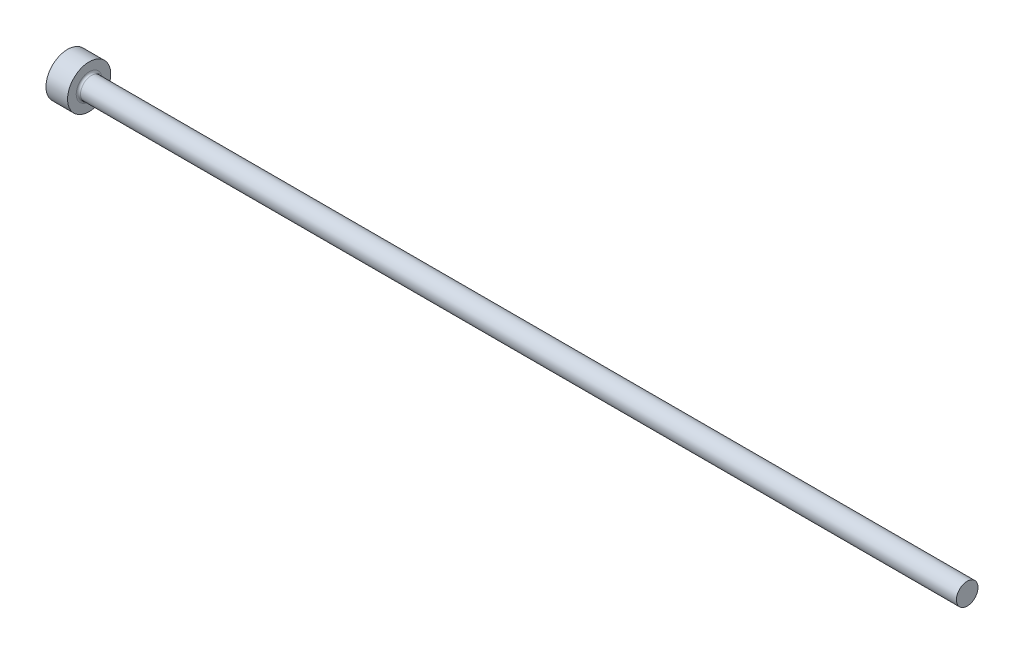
ISO-10303-21;
HEADER;
FILE_DESCRIPTION(('STEP AP214'),'2;1');
FILE_NAME('part.step','',(''),(''),'','','');
FILE_SCHEMA(('AUTOMOTIVE_DESIGN { 1 0 10303 214 1 1 1 1 }'));
ENDSEC;
DATA;
#1=APPLICATION_CONTEXT('core data for automotive mechanical design processes');
#2=APPLICATION_PROTOCOL_DEFINITION('international standard','automotive_design',2000,#1);
#3=PRODUCT_CONTEXT('',#1,'mechanical');
#4=PRODUCT('Part','Part','',(#3));
#5=PRODUCT_RELATED_PRODUCT_CATEGORY('part','',(#4));
#6=PRODUCT_DEFINITION_FORMATION('','',#4);
#7=PRODUCT_DEFINITION_CONTEXT('part definition',#1,'design');
#8=PRODUCT_DEFINITION('design','',#6,#7);
#9=PRODUCT_DEFINITION_SHAPE('','',#8);
#10=(LENGTH_UNIT() NAMED_UNIT(*) SI_UNIT(.MILLI.,.METRE.));
#11=(NAMED_UNIT(*) PLANE_ANGLE_UNIT() SI_UNIT($,.RADIAN.));
#12=(NAMED_UNIT(*) SI_UNIT($,.STERADIAN.) SOLID_ANGLE_UNIT());
#13=UNCERTAINTY_MEASURE_WITH_UNIT(LENGTH_MEASURE(1.E-05),#10,'distance_accuracy_value','');
#14=(GEOMETRIC_REPRESENTATION_CONTEXT(3) GLOBAL_UNCERTAINTY_ASSIGNED_CONTEXT((#13)) GLOBAL_UNIT_ASSIGNED_CONTEXT((#10,
#11,#12)) REPRESENTATION_CONTEXT('',''));
#15=CARTESIAN_POINT('',(0.,0.,0.));
#16=DIRECTION('',(0.,0.,1.));
#17=DIRECTION('',(1.,0.,0.));
#18=AXIS2_PLACEMENT_3D('',#15,#16,#17);
#19=CARTESIAN_POINT('',(0.,0.,0.));
#20=DIRECTION('',(-1.,0.,0.));
#21=DIRECTION('',(0.,-1.,0.));
#22=AXIS2_PLACEMENT_3D('',#19,#20,#21);
#23=PLANE('',#22);
#24=CARTESIAN_POINT('',(0.,0.,0.));
#25=DIRECTION('',(1.,0.,0.));
#26=DIRECTION('',(0.,1.,0.));
#27=AXIS2_PLACEMENT_3D('',#24,#25,#26);
#28=CIRCLE('',#27,3.);
#29=CARTESIAN_POINT('',(0.,3.,0.));
#30=VERTEX_POINT('',#29);
#31=EDGE_CURVE('E25',#30,#30,#28,.T.);
#32=ORIENTED_EDGE('',*,*,#31,.F.);
#33=EDGE_LOOP('',(#32));
#34=FACE_BOUND('',#33,.T.);
#35=ADVANCED_FACE('F14',(#34),#23,.T.);
#36=CARTESIAN_POINT('',(125.,0.,0.));
#37=DIRECTION('',(1.,0.,0.));
#38=DIRECTION('',(0.,1.,0.));
#39=AXIS2_PLACEMENT_3D('',#36,#37,#38);
#40=CYLINDRICAL_SURFACE('',#39,3.);
#41=ORIENTED_EDGE('',*,*,#31,.T.);
#42=EDGE_LOOP('',(#41));
#43=FACE_BOUND('',#42,.T.);
#44=CARTESIAN_POINT('',(3.,0.,0.));
#45=DIRECTION('',(1.,0.,0.));
#46=DIRECTION('',(0.,1.,0.));
#47=AXIS2_PLACEMENT_3D('',#44,#45,#46);
#48=CIRCLE('',#47,3.);
#49=CARTESIAN_POINT('',(3.,3.,0.));
#50=VERTEX_POINT('',#49);
#51=EDGE_CURVE('E29',#50,#50,#48,.T.);
#52=ORIENTED_EDGE('',*,*,#51,.F.);
#53=EDGE_LOOP('',(#52));
#54=FACE_BOUND('',#53,.T.);
#55=ADVANCED_FACE('F51',(#43,#54),#40,.T.);
#56=CARTESIAN_POINT('',(3.,3.,0.));
#57=DIRECTION('',(1.,0.,0.));
#58=DIRECTION('',(0.,1.,0.));
#59=AXIS2_PLACEMENT_3D('',#56,#57,#58);
#60=PLANE('',#59);
#61=CARTESIAN_POINT('',(3.,0.,0.));
#62=DIRECTION('',(1.,0.,0.));
#63=DIRECTION('',(0.,1.,0.));
#64=AXIS2_PLACEMENT_3D('',#61,#62,#63);
#65=CIRCLE('',#64,1.79999999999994);
#66=CARTESIAN_POINT('',(3.,1.79999999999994,0.));
#67=VERTEX_POINT('',#66);
#68=EDGE_CURVE('E9',#67,#67,#65,.F.);
#69=ORIENTED_EDGE('',*,*,#68,.T.);
#70=EDGE_LOOP('',(#69));
#71=FACE_BOUND('',#70,.T.);
#72=ORIENTED_EDGE('',*,*,#51,.T.);
#73=EDGE_LOOP('',(#72));
#74=FACE_BOUND('',#73,.T.);
#75=ADVANCED_FACE('F42',(#71,#74),#60,.T.);
#76=CARTESIAN_POINT('',(125.,0.,0.));
#77=DIRECTION('',(1.,0.,0.));
#78=DIRECTION('',(0.,1.,0.));
#79=AXIS2_PLACEMENT_3D('',#76,#77,#78);
#80=CYLINDRICAL_SURFACE('',#79,1.49999999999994);
#81=CARTESIAN_POINT('',(3.3,0.,0.));
#82=DIRECTION('',(1.,0.,0.));
#83=DIRECTION('',(0.,1.,0.));
#84=AXIS2_PLACEMENT_3D('',#81,#82,#83);
#85=CIRCLE('',#84,1.49999999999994);
#86=CARTESIAN_POINT('',(3.3,1.49999999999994,0.));
#87=VERTEX_POINT('',#86);
#88=EDGE_CURVE('E21',#87,#87,#85,.T.);
#89=ORIENTED_EDGE('',*,*,#88,.T.);
#90=EDGE_LOOP('',(#89));
#91=FACE_BOUND('',#90,.T.);
#92=CARTESIAN_POINT('',(125.,0.,0.));
#93=DIRECTION('',(1.,0.,0.));
#94=DIRECTION('',(0.,1.,0.));
#95=AXIS2_PLACEMENT_3D('',#92,#93,#94);
#96=CIRCLE('',#95,1.49999999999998);
#97=CARTESIAN_POINT('',(125.,1.49999999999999,0.));
#98=VERTEX_POINT('',#97);
#99=EDGE_CURVE('E34',#98,#98,#96,.T.);
#100=ORIENTED_EDGE('',*,*,#99,.F.);
#101=EDGE_LOOP('',(#100));
#102=FACE_BOUND('',#101,.T.);
#103=ADVANCED_FACE('F40',(#91,#102),#80,.T.);
#104=CARTESIAN_POINT('',(125.,1.49999999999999,0.));
#105=DIRECTION('',(1.,0.,0.));
#106=DIRECTION('',(0.,1.,0.));
#107=AXIS2_PLACEMENT_3D('',#104,#105,#106);
#108=PLANE('',#107);
#109=ORIENTED_EDGE('',*,*,#99,.T.);
#110=EDGE_LOOP('',(#109));
#111=FACE_BOUND('',#110,.T.);
#112=ADVANCED_FACE('F38',(#111),#108,.T.);
#113=CARTESIAN_POINT('',(3.3,0.,0.));
#114=DIRECTION('',(1.,0.,0.));
#115=DIRECTION('',(0.,1.,0.));
#116=AXIS2_PLACEMENT_3D('',#113,#114,#115);
#117=TOROIDAL_SURFACE('',#116,1.79999999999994,0.3);
#118=ORIENTED_EDGE('',*,*,#68,.F.);
#119=EDGE_LOOP('',(#118));
#120=FACE_BOUND('',#119,.T.);
#121=ORIENTED_EDGE('',*,*,#88,.F.);
#122=EDGE_LOOP('',(#121));
#123=FACE_BOUND('',#122,.T.);
#124=ADVANCED_FACE('F16',(#120,#123),#117,.F.);
#125=CLOSED_SHELL('',(#35,#55,#75,#103,#112,#124));
#126=MANIFOLD_SOLID_BREP('B1',#125);
#127=ADVANCED_BREP_SHAPE_REPRESENTATION('',(#18,#126),#14);
#128=SHAPE_DEFINITION_REPRESENTATION(#9,#127);
ENDSEC;
END-ISO-10303-21;
